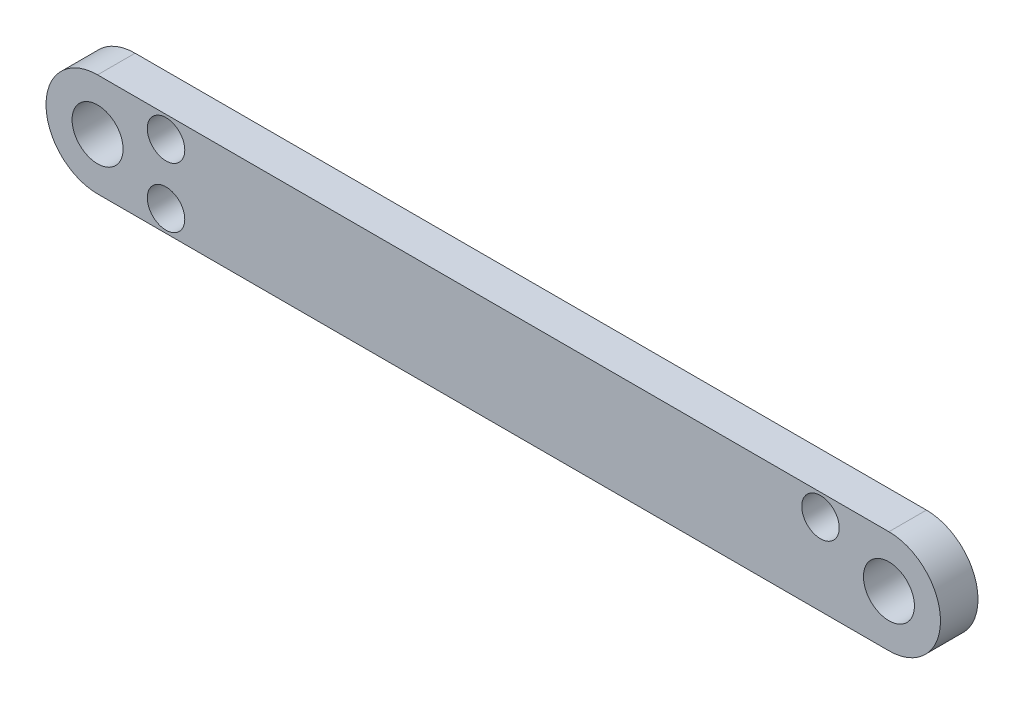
ISO-10303-21;
HEADER;
FILE_DESCRIPTION(('STEP AP214'),'2;1');
FILE_NAME('part.step','',(''),(''),'','','');
FILE_SCHEMA(('AUTOMOTIVE_DESIGN { 1 0 10303 214 1 1 1 1 }'));
ENDSEC;
DATA;
#1=APPLICATION_CONTEXT('core data for automotive mechanical design processes');
#2=APPLICATION_PROTOCOL_DEFINITION('international standard','automotive_design',2000,#1);
#3=PRODUCT_CONTEXT('',#1,'mechanical');
#4=PRODUCT('Part','Part','',(#3));
#5=PRODUCT_RELATED_PRODUCT_CATEGORY('part','',(#4));
#6=PRODUCT_DEFINITION_FORMATION('','',#4);
#7=PRODUCT_DEFINITION_CONTEXT('part definition',#1,'design');
#8=PRODUCT_DEFINITION('design','',#6,#7);
#9=PRODUCT_DEFINITION_SHAPE('','',#8);
#10=(LENGTH_UNIT() NAMED_UNIT(*) SI_UNIT(.MILLI.,.METRE.));
#11=(NAMED_UNIT(*) PLANE_ANGLE_UNIT() SI_UNIT($,.RADIAN.));
#12=(NAMED_UNIT(*) SI_UNIT($,.STERADIAN.) SOLID_ANGLE_UNIT());
#13=UNCERTAINTY_MEASURE_WITH_UNIT(LENGTH_MEASURE(1.E-05),#10,'distance_accuracy_value','');
#14=(GEOMETRIC_REPRESENTATION_CONTEXT(3) GLOBAL_UNCERTAINTY_ASSIGNED_CONTEXT((#13)) GLOBAL_UNIT_ASSIGNED_CONTEXT((#10,
#11,#12)) REPRESENTATION_CONTEXT('',''));
#15=CARTESIAN_POINT('',(0.,0.,0.));
#16=DIRECTION('',(0.,0.,1.));
#17=DIRECTION('',(1.,0.,0.));
#18=AXIS2_PLACEMENT_3D('',#15,#16,#17);
#19=CARTESIAN_POINT('',(-26.797,0.,2.54));
#20=DIRECTION('',(0.,0.,-1.));
#21=DIRECTION('',(-1.,0.,0.));
#22=AXIS2_PLACEMENT_3D('',#19,#20,#21);
#23=CYLINDRICAL_SURFACE('',#22,3.4925);
#24=CARTESIAN_POINT('',(-26.797,0.,0.));
#25=DIRECTION('',(0.,0.,1.));
#26=DIRECTION('',(1.,0.,0.));
#27=AXIS2_PLACEMENT_3D('',#24,#25,#26);
#28=CIRCLE('',#27,3.4925);
#29=CARTESIAN_POINT('',(-26.797,3.4925,0.));
#30=VERTEX_POINT('',#29);
#31=CARTESIAN_POINT('',(-26.797,-3.4925,0.));
#32=VERTEX_POINT('',#31);
#33=EDGE_CURVE('E96',#30,#32,#28,.T.);
#34=ORIENTED_EDGE('',*,*,#33,.T.);
#35=DIRECTION('',(0.,0.,-1.));
#36=VECTOR('',#35,1.);
#37=CARTESIAN_POINT('',(-26.797,-3.4925,2.54));
#38=LINE('',#37,#36);
#39=CARTESIAN_POINT('',(-26.797,-3.4925,2.54));
#40=VERTEX_POINT('',#39);
#41=EDGE_CURVE('E11',#40,#32,#38,.T.);
#42=ORIENTED_EDGE('',*,*,#41,.F.);
#43=CARTESIAN_POINT('',(-26.797,0.,2.54));
#44=DIRECTION('',(0.,0.,1.));
#45=DIRECTION('',(1.,0.,0.));
#46=AXIS2_PLACEMENT_3D('',#43,#44,#45);
#47=CIRCLE('',#46,3.4925);
#48=CARTESIAN_POINT('',(-26.797,3.4925,2.54));
#49=VERTEX_POINT('',#48);
#50=EDGE_CURVE('E84',#49,#40,#47,.T.);
#51=ORIENTED_EDGE('',*,*,#50,.F.);
#52=DIRECTION('',(0.,0.,-1.));
#53=VECTOR('',#52,1.);
#54=CARTESIAN_POINT('',(-26.797,3.4925,2.54));
#55=LINE('',#54,#53);
#56=EDGE_CURVE('E92',#49,#30,#55,.T.);
#57=ORIENTED_EDGE('',*,*,#56,.T.);
#58=EDGE_LOOP('',(#34,#42,#51,#57));
#59=FACE_BOUND('',#58,.T.);
#60=ADVANCED_FACE('F33',(#59),#23,.T.);
#61=CARTESIAN_POINT('',(-26.797,-3.4925,2.54));
#62=DIRECTION('',(0.,1.,0.));
#63=DIRECTION('',(-1.,0.,0.));
#64=AXIS2_PLACEMENT_3D('',#61,#62,#63);
#65=PLANE('',#64);
#66=DIRECTION('',(1.,0.,0.));
#67=VECTOR('',#66,1.);
#68=CARTESIAN_POINT('',(-26.797,-3.4925,0.));
#69=LINE('',#68,#67);
#70=CARTESIAN_POINT('',(26.797,-3.4925,0.));
#71=VERTEX_POINT('',#70);
#72=EDGE_CURVE('E88',#32,#71,#69,.T.);
#73=ORIENTED_EDGE('',*,*,#72,.T.);
#74=DIRECTION('',(0.,0.,-1.));
#75=VECTOR('',#74,1.);
#76=CARTESIAN_POINT('',(26.797,-3.4925,2.54));
#77=LINE('',#76,#75);
#78=CARTESIAN_POINT('',(26.797,-3.4925,2.54));
#79=VERTEX_POINT('',#78);
#80=EDGE_CURVE('E41',#79,#71,#77,.T.);
#81=ORIENTED_EDGE('',*,*,#80,.F.);
#82=DIRECTION('',(1.,0.,0.));
#83=VECTOR('',#82,1.);
#84=CARTESIAN_POINT('',(-26.797,-3.4925,2.54));
#85=LINE('',#84,#83);
#86=EDGE_CURVE('E79',#40,#79,#85,.T.);
#87=ORIENTED_EDGE('',*,*,#86,.F.);
#88=ORIENTED_EDGE('',*,*,#41,.T.);
#89=EDGE_LOOP('',(#73,#81,#87,#88));
#90=FACE_BOUND('',#89,.T.);
#91=ADVANCED_FACE('F87',(#90),#65,.F.);
#92=CARTESIAN_POINT('',(26.797,0.,2.54));
#93=DIRECTION('',(0.,0.,-1.));
#94=DIRECTION('',(-1.,0.,0.));
#95=AXIS2_PLACEMENT_3D('',#92,#93,#94);
#96=CYLINDRICAL_SURFACE('',#95,3.4925);
#97=CARTESIAN_POINT('',(26.797,0.,0.));
#98=DIRECTION('',(0.,0.,1.));
#99=DIRECTION('',(1.,0.,0.));
#100=AXIS2_PLACEMENT_3D('',#97,#98,#99);
#101=CIRCLE('',#100,3.4925);
#102=CARTESIAN_POINT('',(26.797,3.49250000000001,0.));
#103=VERTEX_POINT('',#102);
#104=EDGE_CURVE('E66',#71,#103,#101,.T.);
#105=ORIENTED_EDGE('',*,*,#104,.T.);
#106=DIRECTION('',(0.,0.,-1.));
#107=VECTOR('',#106,1.);
#108=CARTESIAN_POINT('',(26.797,3.49250000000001,2.54));
#109=LINE('',#108,#107);
#110=CARTESIAN_POINT('',(26.797,3.49250000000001,2.54));
#111=VERTEX_POINT('',#110);
#112=EDGE_CURVE('E89',#111,#103,#109,.T.);
#113=ORIENTED_EDGE('',*,*,#112,.F.);
#114=CARTESIAN_POINT('',(26.797,0.,2.54));
#115=DIRECTION('',(0.,0.,1.));
#116=DIRECTION('',(1.,0.,0.));
#117=AXIS2_PLACEMENT_3D('',#114,#115,#116);
#118=CIRCLE('',#117,3.4925);
#119=EDGE_CURVE('E82',#79,#111,#118,.T.);
#120=ORIENTED_EDGE('',*,*,#119,.F.);
#121=ORIENTED_EDGE('',*,*,#80,.T.);
#122=EDGE_LOOP('',(#105,#113,#120,#121));
#123=FACE_BOUND('',#122,.T.);
#124=ADVANCED_FACE('F90',(#123),#96,.T.);
#125=CARTESIAN_POINT('',(-26.797,3.4925,2.54));
#126=DIRECTION('',(0.,-1.,0.));
#127=DIRECTION('',(1.,0.,0.));
#128=AXIS2_PLACEMENT_3D('',#125,#126,#127);
#129=PLANE('',#128);
#130=DIRECTION('',(-1.,0.,0.));
#131=VECTOR('',#130,1.);
#132=CARTESIAN_POINT('',(-26.797,3.4925,0.));
#133=LINE('',#132,#131);
#134=EDGE_CURVE('E72',#103,#30,#133,.T.);
#135=ORIENTED_EDGE('',*,*,#134,.T.);
#136=ORIENTED_EDGE('',*,*,#56,.F.);
#137=DIRECTION('',(-1.,0.,0.));
#138=VECTOR('',#137,1.);
#139=CARTESIAN_POINT('',(-26.797,3.4925,2.54));
#140=LINE('',#139,#138);
#141=EDGE_CURVE('E49',#111,#49,#140,.T.);
#142=ORIENTED_EDGE('',*,*,#141,.F.);
#143=ORIENTED_EDGE('',*,*,#112,.T.);
#144=EDGE_LOOP('',(#135,#136,#142,#143));
#145=FACE_BOUND('',#144,.T.);
#146=ADVANCED_FACE('F104',(#145),#129,.F.);
#147=CARTESIAN_POINT('',(-26.797,0.,2.54));
#148=DIRECTION('',(0.,0.,1.));
#149=DIRECTION('',(1.,0.,0.));
#150=AXIS2_PLACEMENT_3D('',#147,#148,#149);
#151=PLANE('',#150);
#152=CARTESIAN_POINT('',(-22.1615,2.032,2.54));
#153=DIRECTION('',(0.,0.,1.));
#154=DIRECTION('',(1.,0.,0.));
#155=AXIS2_PLACEMENT_3D('',#152,#153,#154);
#156=CIRCLE('',#155,1.27);
#157=CARTESIAN_POINT('',(-20.8915,2.032,2.54));
#158=VERTEX_POINT('',#157);
#159=EDGE_CURVE('E134',#158,#158,#156,.T.);
#160=ORIENTED_EDGE('',*,*,#159,.F.);
#161=EDGE_LOOP('',(#160));
#162=FACE_BOUND('',#161,.T.);
#163=CARTESIAN_POINT('',(-22.1615,-2.032,2.54));
#164=DIRECTION('',(0.,0.,1.));
#165=DIRECTION('',(1.,0.,0.));
#166=AXIS2_PLACEMENT_3D('',#163,#164,#165);
#167=CIRCLE('',#166,1.27);
#168=CARTESIAN_POINT('',(-20.8915,-2.032,2.54));
#169=VERTEX_POINT('',#168);
#170=EDGE_CURVE('E128',#169,#169,#167,.T.);
#171=ORIENTED_EDGE('',*,*,#170,.F.);
#172=EDGE_LOOP('',(#171));
#173=FACE_BOUND('',#172,.T.);
#174=CARTESIAN_POINT('',(22.1615,2.032,2.54));
#175=DIRECTION('',(0.,0.,1.));
#176=DIRECTION('',(1.,0.,0.));
#177=AXIS2_PLACEMENT_3D('',#174,#175,#176);
#178=CIRCLE('',#177,1.27);
#179=CARTESIAN_POINT('',(23.4315,2.032,2.54));
#180=VERTEX_POINT('',#179);
#181=EDGE_CURVE('E122',#180,#180,#178,.T.);
#182=ORIENTED_EDGE('',*,*,#181,.F.);
#183=EDGE_LOOP('',(#182));
#184=FACE_BOUND('',#183,.T.);
#185=CARTESIAN_POINT('',(-26.797,0.,2.54));
#186=DIRECTION('',(0.,0.,1.));
#187=DIRECTION('',(1.,0.,0.));
#188=AXIS2_PLACEMENT_3D('',#185,#186,#187);
#189=CIRCLE('',#188,1.72719999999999);
#190=CARTESIAN_POINT('',(-25.0698,0.,2.54));
#191=VERTEX_POINT('',#190);
#192=EDGE_CURVE('E118',#191,#191,#189,.T.);
#193=ORIENTED_EDGE('',*,*,#192,.F.);
#194=EDGE_LOOP('',(#193));
#195=FACE_BOUND('',#194,.T.);
#196=CARTESIAN_POINT('',(26.797,0.,2.54));
#197=DIRECTION('',(0.,0.,1.));
#198=DIRECTION('',(1.,0.,0.));
#199=AXIS2_PLACEMENT_3D('',#196,#197,#198);
#200=CIRCLE('',#199,1.72719999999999);
#201=CARTESIAN_POINT('',(28.5242,0.,2.54));
#202=VERTEX_POINT('',#201);
#203=EDGE_CURVE('E112',#202,#202,#200,.T.);
#204=ORIENTED_EDGE('',*,*,#203,.F.);
#205=EDGE_LOOP('',(#204));
#206=FACE_BOUND('',#205,.T.);
#207=ORIENTED_EDGE('',*,*,#50,.T.);
#208=ORIENTED_EDGE('',*,*,#86,.T.);
#209=ORIENTED_EDGE('',*,*,#119,.T.);
#210=ORIENTED_EDGE('',*,*,#141,.T.);
#211=EDGE_LOOP('',(#207,#208,#209,#210));
#212=FACE_BOUND('',#211,.T.);
#213=ADVANCED_FACE('F80',(#162,#173,#184,#195,#206,#212),#151,.T.);
#214=CARTESIAN_POINT('',(-26.797,0.,0.));
#215=DIRECTION('',(0.,0.,1.));
#216=DIRECTION('',(1.,0.,0.));
#217=AXIS2_PLACEMENT_3D('',#214,#215,#216);
#218=PLANE('',#217);
#219=CARTESIAN_POINT('',(-22.1615,2.032,0.));
#220=DIRECTION('',(0.,0.,1.));
#221=DIRECTION('',(1.,0.,0.));
#222=AXIS2_PLACEMENT_3D('',#219,#220,#221);
#223=CIRCLE('',#222,1.27);
#224=CARTESIAN_POINT('',(-20.8915,2.032,0.));
#225=VERTEX_POINT('',#224);
#226=EDGE_CURVE('E131',#225,#225,#223,.T.);
#227=ORIENTED_EDGE('',*,*,#226,.T.);
#228=EDGE_LOOP('',(#227));
#229=FACE_BOUND('',#228,.T.);
#230=CARTESIAN_POINT('',(-22.1615,-2.032,0.));
#231=DIRECTION('',(0.,0.,1.));
#232=DIRECTION('',(1.,0.,0.));
#233=AXIS2_PLACEMENT_3D('',#230,#231,#232);
#234=CIRCLE('',#233,1.27);
#235=CARTESIAN_POINT('',(-20.8915,-2.032,0.));
#236=VERTEX_POINT('',#235);
#237=EDGE_CURVE('E125',#236,#236,#234,.T.);
#238=ORIENTED_EDGE('',*,*,#237,.T.);
#239=EDGE_LOOP('',(#238));
#240=FACE_BOUND('',#239,.T.);
#241=CARTESIAN_POINT('',(22.1615,2.032,0.));
#242=DIRECTION('',(0.,0.,1.));
#243=DIRECTION('',(1.,0.,0.));
#244=AXIS2_PLACEMENT_3D('',#241,#242,#243);
#245=CIRCLE('',#244,1.27);
#246=CARTESIAN_POINT('',(23.4315,2.032,0.));
#247=VERTEX_POINT('',#246);
#248=EDGE_CURVE('E121',#247,#247,#245,.T.);
#249=ORIENTED_EDGE('',*,*,#248,.T.);
#250=EDGE_LOOP('',(#249));
#251=FACE_BOUND('',#250,.T.);
#252=CARTESIAN_POINT('',(-26.797,0.,0.));
#253=DIRECTION('',(0.,0.,1.));
#254=DIRECTION('',(1.,0.,0.));
#255=AXIS2_PLACEMENT_3D('',#252,#253,#254);
#256=CIRCLE('',#255,1.72719999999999);
#257=CARTESIAN_POINT('',(-25.0698,0.,0.));
#258=VERTEX_POINT('',#257);
#259=EDGE_CURVE('E115',#258,#258,#256,.T.);
#260=ORIENTED_EDGE('',*,*,#259,.T.);
#261=EDGE_LOOP('',(#260));
#262=FACE_BOUND('',#261,.T.);
#263=CARTESIAN_POINT('',(26.797,0.,0.));
#264=DIRECTION('',(0.,0.,1.));
#265=DIRECTION('',(1.,0.,0.));
#266=AXIS2_PLACEMENT_3D('',#263,#264,#265);
#267=CIRCLE('',#266,1.72719999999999);
#268=CARTESIAN_POINT('',(28.5242,0.,0.));
#269=VERTEX_POINT('',#268);
#270=EDGE_CURVE('E99',#269,#269,#267,.T.);
#271=ORIENTED_EDGE('',*,*,#270,.T.);
#272=EDGE_LOOP('',(#271));
#273=FACE_BOUND('',#272,.T.);
#274=ORIENTED_EDGE('',*,*,#33,.F.);
#275=ORIENTED_EDGE('',*,*,#134,.F.);
#276=ORIENTED_EDGE('',*,*,#104,.F.);
#277=ORIENTED_EDGE('',*,*,#72,.F.);
#278=EDGE_LOOP('',(#274,#275,#276,#277));
#279=FACE_BOUND('',#278,.T.);
#280=ADVANCED_FACE('F107',(#229,#240,#251,#262,#273,#279),#218,.F.);
#281=CARTESIAN_POINT('',(26.797,0.,2.54));
#282=DIRECTION('',(0.,0.,1.));
#283=DIRECTION('',(1.,0.,0.));
#284=AXIS2_PLACEMENT_3D('',#281,#282,#283);
#285=CYLINDRICAL_SURFACE('',#284,1.72719999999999);
#286=ORIENTED_EDGE('',*,*,#203,.T.);
#287=EDGE_LOOP('',(#286));
#288=FACE_BOUND('',#287,.T.);
#289=ORIENTED_EDGE('',*,*,#270,.F.);
#290=EDGE_LOOP('',(#289));
#291=FACE_BOUND('',#290,.T.);
#292=ADVANCED_FACE('F160',(#288,#291),#285,.F.);
#293=CARTESIAN_POINT('',(-26.797,0.,2.54));
#294=DIRECTION('',(0.,0.,1.));
#295=DIRECTION('',(1.,0.,0.));
#296=AXIS2_PLACEMENT_3D('',#293,#294,#295);
#297=CYLINDRICAL_SURFACE('',#296,1.72719999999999);
#298=ORIENTED_EDGE('',*,*,#192,.T.);
#299=EDGE_LOOP('',(#298));
#300=FACE_BOUND('',#299,.T.);
#301=ORIENTED_EDGE('',*,*,#259,.F.);
#302=EDGE_LOOP('',(#301));
#303=FACE_BOUND('',#302,.T.);
#304=ADVANCED_FACE('F163',(#300,#303),#297,.F.);
#305=CARTESIAN_POINT('',(22.1615,2.032,0.));
#306=DIRECTION('',(0.,0.,1.));
#307=DIRECTION('',(1.,0.,0.));
#308=AXIS2_PLACEMENT_3D('',#305,#306,#307);
#309=CYLINDRICAL_SURFACE('',#308,1.27);
#310=ORIENTED_EDGE('',*,*,#248,.F.);
#311=EDGE_LOOP('',(#310));
#312=FACE_BOUND('',#311,.T.);
#313=ORIENTED_EDGE('',*,*,#181,.T.);
#314=EDGE_LOOP('',(#313));
#315=FACE_BOUND('',#314,.T.);
#316=ADVANCED_FACE('F204',(#312,#315),#309,.F.);
#317=CARTESIAN_POINT('',(-22.1615,-2.032,0.));
#318=DIRECTION('',(0.,0.,1.));
#319=DIRECTION('',(1.,0.,0.));
#320=AXIS2_PLACEMENT_3D('',#317,#318,#319);
#321=CYLINDRICAL_SURFACE('',#320,1.27);
#322=ORIENTED_EDGE('',*,*,#237,.F.);
#323=EDGE_LOOP('',(#322));
#324=FACE_BOUND('',#323,.T.);
#325=ORIENTED_EDGE('',*,*,#170,.T.);
#326=EDGE_LOOP('',(#325));
#327=FACE_BOUND('',#326,.T.);
#328=ADVANCED_FACE('F145',(#324,#327),#321,.F.);
#329=CARTESIAN_POINT('',(-22.1615,2.032,0.));
#330=DIRECTION('',(0.,0.,1.));
#331=DIRECTION('',(1.,0.,0.));
#332=AXIS2_PLACEMENT_3D('',#329,#330,#331);
#333=CYLINDRICAL_SURFACE('',#332,1.27);
#334=ORIENTED_EDGE('',*,*,#226,.F.);
#335=EDGE_LOOP('',(#334));
#336=FACE_BOUND('',#335,.T.);
#337=ORIENTED_EDGE('',*,*,#159,.T.);
#338=EDGE_LOOP('',(#337));
#339=FACE_BOUND('',#338,.T.);
#340=ADVANCED_FACE('F142',(#336,#339),#333,.F.);
#341=CLOSED_SHELL('',(#60,#91,#124,#146,#213,#280,#292,#304,#316,#328,#340));
#342=MANIFOLD_SOLID_BREP('B2',#341);
#343=ADVANCED_BREP_SHAPE_REPRESENTATION('',(#18,#342),#14);
#344=SHAPE_DEFINITION_REPRESENTATION(#9,#343);
ENDSEC;
END-ISO-10303-21;
